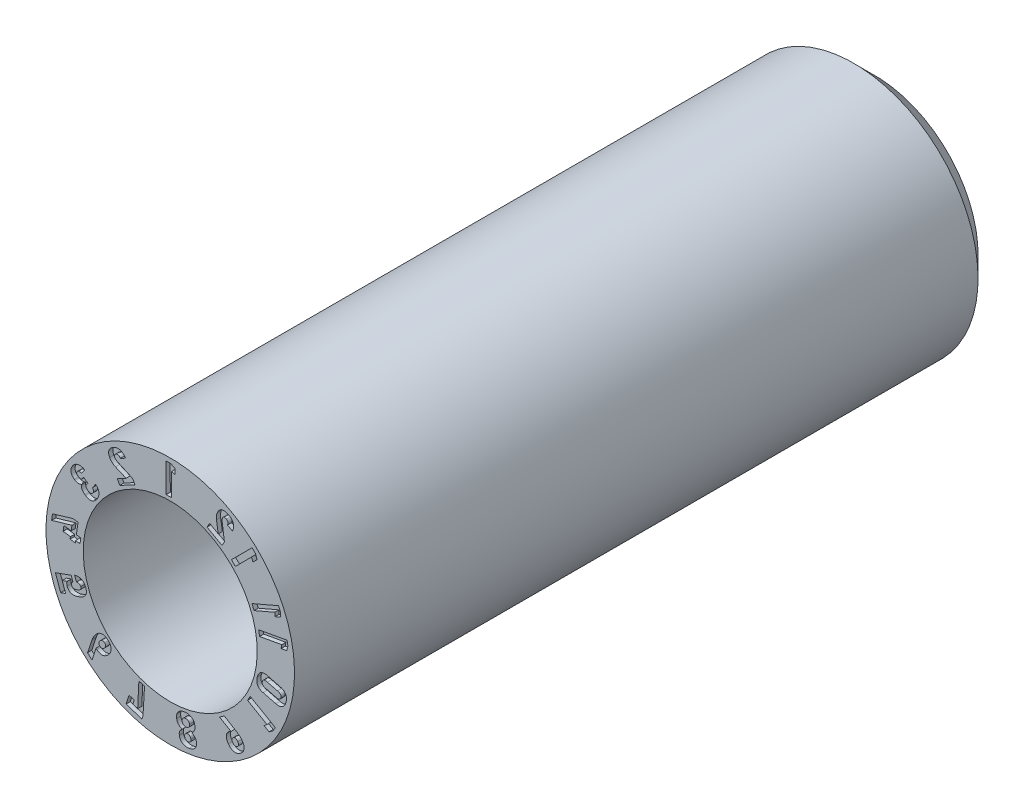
from build123d import *

# Parameters (mm, degrees)
CUT_EXTRUDE1_DEPTH = 0.1


with BuildPart() as part:
    # Sketch1 → Revolve1 (revolve)
    with BuildSketch(Plane(origin=(0, 0, 0), x_dir=(0, 0, -1), z_dir=(1, 0, 0)), mode=Mode.PRIVATE) as revolve1_sk:
        Polygon((17, 1.5), (17, 2.5), (16.5, 3), (0, 3), (0, 2.1), (3, 2.1), (3, 0.8), (12, 0.8), (12, 1.5), align=None)
    revolve(revolve1_sk.sketch.rotate(Axis((0, 0, 0), (0, 0, -1)), 180), axis=Axis((0, 0, 0), (0, 0, -1)))

    # Sketch2 → Cut-Extrude1 (cut)
    # profile 1 of 15: a face of its own
    with BuildSketch(Plane.XY):
        Polygon((-0.098720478, 2.183361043), (0.033456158, 2.18410041), (0.030635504, 2.730707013), (0.116357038, 2.698664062), (0.115654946, 2.839287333), (0.010584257, 2.885948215), (-0.102281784, 2.885328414), align=None)
    # profile 2 of 15: a face of its own
    with BuildSketch(Plane.XY):
        with BuildLine():
            Line((-0.909098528, 2.115845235), (-1.270014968, 2.279834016))
            add(Edge.make_bspline(
                [(-1.270014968, 2.279834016), (-1.285183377, 2.286827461), (-1.303513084, 2.297164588), (-1.321424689, 2.313703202), (-1.331285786, 2.324078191), (-1.337237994, 2.332679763), (-1.34046237, 2.338587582)],
                knots=[0, 0, 0, 0, 0.540031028, 0.66553244, 0.783527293, 1, 1, 1, 1], degree=3))
            add(Edge.make_bspline(
                [(-1.34046237, 2.338587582), (-1.345191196, 2.346859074), (-1.349282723, 2.358912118), (-1.349080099, 2.375373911), (-1.34593905, 2.38686971), (-1.340065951, 2.397752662), (-1.328125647, 2.411955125), (-1.315859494, 2.419934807), (-1.307070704, 2.424732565)],
                knots=[0, 0, 0, 0, 0.246786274, 0.356909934, 0.46944845, 0.586307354, 0.710253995, 1, 1, 1, 1], degree=3))
            add(Edge.make_bspline(
                [(-1.307070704, 2.424732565), (-1.298254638, 2.429437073), (-1.283992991, 2.434470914), (-1.264274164, 2.434539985), (-1.250034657, 2.431328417), (-1.236301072, 2.425121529), (-1.217968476, 2.412442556), (-1.206702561, 2.399086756), (-1.199905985, 2.389271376)],
                knots=[0, 0, 0, 0, 0.240300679, 0.353786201, 0.468512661, 0.587496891, 0.71289196, 1, 1, 1, 1], degree=3))
            Line((-1.199905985, 2.389271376), (-1.080740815, 2.452863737))
            add(Edge.make_bspline(
                [(-1.080740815, 2.452863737), (-1.091852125, 2.470709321), (-1.110121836, 2.494775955), (-1.13894901, 2.521479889), (-1.161443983, 2.537524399), (-1.185017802, 2.550216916), (-1.209502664, 2.559421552), (-1.234868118, 2.56462525), (-1.260823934, 2.566464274), (-1.287247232, 2.564674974), (-1.323430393, 2.556885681), (-1.349667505, 2.546235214), (-1.366473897, 2.53703459)],
                knots=[0, 0, 0, 0, 0.185247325, 0.270908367, 0.35379884, 0.433963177, 0.511943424, 0.589014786, 0.666847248, 0.746166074, 0.827198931, 1, 1, 1, 1], degree=3))
            add(Edge.make_bspline(
                [(-1.366473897, 2.53703459), (-1.384304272, 2.527354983), (-1.409307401, 2.511340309), (-1.437802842, 2.485684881), (-1.454939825, 2.465742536), (-1.468681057, 2.444841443), (-1.478807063, 2.422955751), (-1.485462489, 2.400219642), (-1.488089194, 2.376638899), (-1.487354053, 2.352479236), (-1.480773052, 2.318756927), (-1.470657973, 2.294302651), (-1.462098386, 2.278504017)],
                knots=[0, 0, 0, 0, 0.194582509, 0.283014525, 0.366623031, 0.445927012, 0.521986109, 0.596944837, 0.671952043, 0.748457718, 0.827747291, 1, 1, 1, 1], degree=3))
            add(Edge.make_bspline(
                [(-1.462098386, 2.278504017), (-1.454227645, 2.264109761), (-1.441177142, 2.243880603), (-1.420009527, 2.219623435), (-1.402682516, 2.202363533), (-1.383956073, 2.186555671), (-1.35741098, 2.168042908), (-1.336191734, 2.156382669), (-1.321424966, 2.150036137)],
                knots=[0, 0, 0, 0, 0.24663637, 0.371530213, 0.498650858, 0.625608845, 0.751024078, 1, 1, 1, 1], degree=3))
            Line((-1.321424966, 2.150036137), (-1.066700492, 2.040346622))
            Line((-1.066700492, 2.040346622), (-1.277167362, 1.926913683))
            Line((-1.277167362, 1.926913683), (-1.216935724, 1.815090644))
            Line((-1.216935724, 1.815090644), (-0.852820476, 2.011242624))
            Line((-0.852820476, 2.011242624), (-0.909098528, 2.115845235))
        make_face()
    # profile 3 of 15: a face of its own
    with BuildSketch(Plane.XY):
        with BuildLine():
            Line((-1.801883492, 1.544980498), (-1.880006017, 1.43385943))
            add(Edge.make_bspline(
                [(-1.880006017, 1.43385943), (-1.87487862, 1.429308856), (-1.868086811, 1.421837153), (-1.860996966, 1.410811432), (-1.856895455, 1.402559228), (-1.854247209, 1.3940888), (-1.85252689, 1.38557761), (-1.852072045, 1.37699943), (-1.852601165, 1.368357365), (-1.854488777, 1.359803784), (-1.8583708, 1.348138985), (-1.863371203, 1.340103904), (-1.866839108, 1.334788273)],
                knots=[0, 0, 0, 0, 0.185947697, 0.272003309, 0.355057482, 0.435080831, 0.512072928, 0.590042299, 0.667454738, 0.746220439, 0.82700958, 1, 1, 1, 1], degree=3))
            add(Edge.make_bspline(
                [(-1.866839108, 1.334788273), (-1.873178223, 1.325537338), (-1.884411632, 1.313429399), (-1.902828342, 1.302947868), (-1.917078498, 1.298987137), (-1.931923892, 1.298289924), (-1.953029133, 1.302259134), (-1.967701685, 1.310347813), (-1.97703908, 1.31673151)],
                knots=[0, 0, 0, 0, 0.265501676, 0.382853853, 0.496663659, 0.611874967, 0.731229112, 1, 1, 1, 1], degree=3))
            Line((-1.97703908, 1.31673151), (-1.990372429, 1.326052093))
            add(Edge.make_bspline(
                [(-1.990372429, 1.326052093), (-1.999848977, 1.333083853), (-2.013496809, 1.343714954), (-2.025737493, 1.361652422), (-2.031598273, 1.374526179), (-2.034274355, 1.387715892), (-2.032931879, 1.405850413), (-2.027186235, 1.418607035), (-2.021608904, 1.426083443)],
                knots=[0, 0, 0, 0, 0.300615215, 0.428560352, 0.545417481, 0.656048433, 0.764757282, 1, 1, 1, 1], degree=3))
            Line((-2.021608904, 1.426083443), (-1.987644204, 1.474290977))
            Line((-1.987644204, 1.474290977), (-2.091297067, 1.547206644))
            Line((-2.091297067, 1.547206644), (-2.125261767, 1.498999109))
            add(Edge.make_bspline(
                [(-2.125261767, 1.498999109), (-2.129461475, 1.49262222), (-2.137924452, 1.484861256), (-2.151872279, 1.479097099), (-2.163256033, 1.47786373), (-2.175428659, 1.478828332), (-2.193267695, 1.484488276), (-2.206151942, 1.491513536), (-2.214435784, 1.497553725)],
                knots=[0, 0, 0, 0, 0.226652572, 0.333129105, 0.444988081, 0.564971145, 0.694921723, 1, 1, 1, 1], degree=3))
            Line((-2.214435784, 1.497553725), (-2.224150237, 1.504381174))
            add(Edge.make_bspline(
                [(-2.224150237, 1.504381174), (-2.231925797, 1.509976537), (-2.242700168, 1.519001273), (-2.252270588, 1.534005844), (-2.256502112, 1.545122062), (-2.257906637, 1.556563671), (-2.256464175, 1.572471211), (-2.250509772, 1.583455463), (-2.245918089, 1.590224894)],
                knots=[0, 0, 0, 0, 0.287811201, 0.411477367, 0.527914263, 0.639876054, 0.752930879, 1, 1, 1, 1], degree=3))
            add(Edge.make_bspline(
                [(-2.245918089, 1.590224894), (-2.242607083, 1.594914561), (-2.236845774, 1.6014217), (-2.227352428, 1.607787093), (-2.219822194, 1.611738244), (-2.211638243, 1.614680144), (-2.202886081, 1.616398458), (-2.193590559, 1.617056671), (-2.18386769, 1.616803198), (-2.173733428, 1.615322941), (-2.15932377, 1.611916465), (-2.148708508, 1.607590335), (-2.14158886, 1.604363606)],
                knots=[0, 0, 0, 0, 0.150181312, 0.223296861, 0.297155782, 0.371585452, 0.449302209, 0.52905163, 0.614285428, 0.702508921, 0.795752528, 1, 1, 1, 1], degree=3))
            Line((-2.14158886, 1.604363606), (-2.063773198, 1.715071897))
            add(Edge.make_bspline(
                [(-2.063773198, 1.715071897), (-2.081248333, 1.725217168), (-2.108368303, 1.737622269), (-2.14599919, 1.747445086), (-2.173334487, 1.750835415), (-2.200112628, 1.750925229), (-2.226050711, 1.747485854), (-2.250939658, 1.740533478), (-2.274718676, 1.730366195), (-2.297037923, 1.716989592), (-2.325229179, 1.695251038), (-2.342768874, 1.674601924), (-2.353244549, 1.659856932)],
                knots=[0, 0, 0, 0, 0.185487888, 0.271925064, 0.356056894, 0.437650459, 0.51709444, 0.595429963, 0.674142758, 0.753752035, 0.833670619, 1, 1, 1, 1], degree=3))
            add(Edge.make_bspline(
                [(-2.353244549, 1.659856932), (-2.361796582, 1.64799191), (-2.372736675, 1.629611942), (-2.384516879, 1.60441102), (-2.391052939, 1.586165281), (-2.395609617, 1.568116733), (-2.398086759, 1.550254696), (-2.39865307, 1.532640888), (-2.397130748, 1.515325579), (-2.39392962, 1.498396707), (-2.388440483, 1.482094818), (-2.381277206, 1.466266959), (-2.37218256, 1.450999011), (-2.360976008, 1.436445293), (-2.342960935, 1.417467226), (-2.32760687, 1.404478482), (-2.316246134, 1.39674606)],
                knots=[0, 0, 0, 0, 0.145024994, 0.211773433, 0.275829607, 0.33708983, 0.396197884, 0.454480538, 0.511605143, 0.568407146, 0.625059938, 0.681891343, 0.740573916, 0.801023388, 0.86380105, 1, 1, 1, 1], degree=3))
            Line((-2.316246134, 1.39674606), (-2.299015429, 1.384577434))
            add(Edge.make_bspline(
                [(-2.299015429, 1.384577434), (-2.286442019, 1.376020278), (-2.266469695, 1.364783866), (-2.237435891, 1.357699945), (-2.215827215, 1.355422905), (-2.194139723, 1.35676088), (-2.165045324, 1.363515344), (-2.144565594, 1.373609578), (-2.131738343, 1.381993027)],
                knots=[0, 0, 0, 0, 0.256766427, 0.378902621, 0.5000938, 0.620743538, 0.742279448, 1, 1, 1, 1], degree=3))
            add(Edge.make_bspline(
                [(-2.131738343, 1.381993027), (-2.135009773, 1.374313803), (-2.138503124, 1.362462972), (-2.141321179, 1.346437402), (-2.142113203, 1.334574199), (-2.141599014, 1.3227474), (-2.140234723, 1.310947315), (-2.13730727, 1.299279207), (-2.132195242, 1.283644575), (-2.122651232, 1.264537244), (-2.100992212, 1.234755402), (-2.079355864, 1.215986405), (-2.063356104, 1.204800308)],
                knots=[0, 0, 0, 0, 0.120941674, 0.178737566, 0.235932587, 0.293131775, 0.35041005, 0.40804081, 0.467422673, 0.589011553, 0.716165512, 1, 1, 1, 1], degree=3))
            Line((-2.063356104, 1.204800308), (-2.045991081, 1.192679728))
            add(Edge.make_bspline(
                [(-2.045991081, 1.192679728), (-2.030330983, 1.182031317), (-2.006328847, 1.167678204), (-1.971978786, 1.156440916), (-1.947194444, 1.151756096), (-1.922643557, 1.151045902), (-1.898606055, 1.154169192), (-1.875036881, 1.160844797), (-1.852264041, 1.1716141), (-1.830145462, 1.185815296), (-1.801006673, 1.210402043), (-1.782348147, 1.233301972), (-1.770636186, 1.249662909)],
                knots=[0, 0, 0, 0, 0.178299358, 0.259714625, 0.338098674, 0.414262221, 0.489195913, 0.564778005, 0.643203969, 0.72472314, 0.810857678, 1, 1, 1, 1], degree=3))
            add(Edge.make_bspline(
                [(-1.770636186, 1.249662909), (-1.759102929, 1.266092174), (-1.74414016, 1.291714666), (-1.730625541, 1.327993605), (-1.723986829, 1.354740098), (-1.721156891, 1.381433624), (-1.721493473, 1.407775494), (-1.725987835, 1.433510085), (-1.733635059, 1.458646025), (-1.74515969, 1.482723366), (-1.766077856, 1.513511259), (-1.786625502, 1.533300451), (-1.801883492, 1.544980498)],
                knots=[0, 0, 0, 0, 0.181472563, 0.266227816, 0.349030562, 0.429720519, 0.508099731, 0.586210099, 0.664894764, 0.744781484, 0.826358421, 1, 1, 1, 1], degree=3))
        make_face()
    # profile 4 of 15: a face of its own
    with BuildSketch(Plane.XY):
        Polygon((-2.346366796, 0.556911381), (-2.843020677, 0.40892151), (-2.863791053, 0.261124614), (-2.373786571, 0.404048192), (-2.391588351, 0.277639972), (-2.56712748, 0.302390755), (-2.585641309, 0.171756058), (-2.409987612, 0.14698912), (-2.417640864, 0.092644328), (-2.291825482, 0.074920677), (-2.284166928, 0.129248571), (-2.177397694, 0.114194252), (-2.158883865, 0.244828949), (-2.265749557, 0.259896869), (-2.226272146, 0.539939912), align=None)
    # profile 5 of 15: a face of its own
    with BuildSketch(Plane.XY):
        with BuildLine():
            Line((-2.307233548, -0.60438587), (-2.263150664, -0.729175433))
            add(Edge.make_bspline(
                [(-2.263150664, -0.729175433), (-2.251377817, -0.726141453), (-2.234344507, -0.723644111), (-2.212524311, -0.726198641), (-2.198187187, -0.730522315), (-2.185600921, -0.737514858), (-2.170980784, -0.750226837), (-2.163998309, -0.763355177), (-2.160560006, -0.772475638)],
                knots=[0, 0, 0, 0, 0.285979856, 0.41291731, 0.532388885, 0.648288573, 0.760985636, 1, 1, 1, 1], degree=3))
            add(Edge.make_bspline(
                [(-2.160560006, -0.772475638), (-2.157176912, -0.782326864), (-2.153751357, -0.797843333), (-2.157623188, -0.817807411), (-2.163482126, -0.831313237), (-2.172841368, -0.8434212), (-2.189938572, -0.858644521), (-2.206436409, -0.866138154), (-2.217988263, -0.870396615)],
                knots=[0, 0, 0, 0, 0.245537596, 0.357255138, 0.469313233, 0.585744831, 0.711147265, 1, 1, 1, 1], degree=3))
            Line((-2.217988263, -0.870396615), (-2.273510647, -0.890140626))
            add(Edge.make_bspline(
                [(-2.273510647, -0.890140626), (-2.285083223, -0.894275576), (-2.302260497, -0.898817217), (-2.324790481, -0.898989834), (-2.339182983, -0.896006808), (-2.351935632, -0.890541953), (-2.36642434, -0.879038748), (-2.37356739, -0.866792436), (-2.376612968, -0.857940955)],
                knots=[0, 0, 0, 0, 0.302844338, 0.431574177, 0.550434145, 0.661796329, 0.76957872, 1, 1, 1, 1], degree=3))
            add(Edge.make_bspline(
                [(-2.376612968, -0.857940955), (-2.379604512, -0.849558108), (-2.382537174, -0.836648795), (-2.382109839, -0.819389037), (-2.379664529, -0.807255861), (-2.375219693, -0.795769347), (-2.366577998, -0.781415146), (-2.357286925, -0.772584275), (-2.350456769, -0.767510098)],
                knots=[0, 0, 0, 0, 0.263342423, 0.385862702, 0.507647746, 0.627191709, 0.748065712, 1, 1, 1, 1], degree=3))
            Line((-2.350456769, -0.767510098), (-2.392047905, -0.651183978))
            Line((-2.392047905, -0.651183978), (-2.772130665, -0.786810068))
            Line((-2.772130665, -0.786810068), (-2.645335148, -1.141872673))
            Line((-2.645335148, -1.141872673), (-2.525233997, -1.099040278))
            Line((-2.525233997, -1.099040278), (-2.607524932, -0.868607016))
            Line((-2.607524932, -0.868607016), (-2.490777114, -0.82685566))
            add(Edge.make_bspline(
                [(-2.490777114, -0.82685566), (-2.49394469, -0.833524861), (-2.496743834, -0.844617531), (-2.498627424, -0.860252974), (-2.498859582, -0.886118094), (-2.494910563, -0.907827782), (-2.489257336, -0.924336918)],
                knots=[0, 0, 0, 0, 0.221259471, 0.34293735, 0.47419753, 1, 1, 1, 1], degree=3))
            add(Edge.make_bspline(
                [(-2.489257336, -0.924336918), (-2.483531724, -0.940369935), (-2.472446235, -0.962972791), (-2.452020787, -0.988595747), (-2.434556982, -1.004133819), (-2.415160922, -1.016893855), (-2.393590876, -1.026325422), (-2.37008561, -1.032336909), (-2.344788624, -1.035395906), (-2.317831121, -1.034945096), (-2.278429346, -1.03055616), (-2.248901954, -1.021685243), (-2.229006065, -1.014769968)],
                knots=[0, 0, 0, 0, 0.16365674, 0.239510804, 0.313508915, 0.387354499, 0.46174098, 0.538606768, 0.619722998, 0.705857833, 0.797118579, 1, 1, 1, 1], degree=3))
            Line((-2.229006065, -1.014769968), (-2.173483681, -0.995025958))
            add(Edge.make_bspline(
                [(-2.173483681, -0.995025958), (-2.15357459, -0.987921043), (-2.125327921, -0.975129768), (-2.092397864, -0.95226371), (-2.071928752, -0.933559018), (-2.054870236, -0.913083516), (-2.041499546, -0.890801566), (-2.031828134, -0.866841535), (-2.025784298, -0.841336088), (-2.023691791, -0.814434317), (-2.025934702, -0.775754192), (-2.033564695, -0.746761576), (-2.040346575, -0.727525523)],
                knots=[0, 0, 0, 0, 0.186939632, 0.272046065, 0.353268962, 0.431220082, 0.506711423, 0.581925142, 0.658650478, 0.737395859, 0.819503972, 1, 1, 1, 1], degree=3))
            add(Edge.make_bspline(
                [(-2.040346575, -0.727525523), (-2.046188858, -0.710429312), (-2.058159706, -0.686374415), (-2.079354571, -0.658084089), (-2.097480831, -0.639744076), (-2.117791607, -0.624016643), (-2.140312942, -0.611682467), (-2.16453337, -0.601967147), (-2.190652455, -0.595682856), (-2.21827195, -0.592599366), (-2.257699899, -0.59324521), (-2.287470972, -0.598758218), (-2.307233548, -0.60438587)],
                knots=[0, 0, 0, 0, 0.165351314, 0.244287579, 0.323078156, 0.400981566, 0.478830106, 0.557643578, 0.63948441, 0.724229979, 0.811685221, 1, 1, 1, 1], degree=3))
        make_face()
    # profile 6 of 15: a face of its own
    with BuildSketch(Plane.XY):
        with BuildLine():
            Line((-1.889555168, -1.75439237), (-1.995138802, -2.070022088))
            Line((-1.995138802, -2.070022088), (-1.887249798, -2.173115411))
            Line((-1.887249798, -2.173115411), (-1.789330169, -1.87100414))
            add(Edge.make_bspline(
                [(-1.789330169, -1.87100414), (-1.784440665, -1.877950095), (-1.778712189, -1.884315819), (-1.772623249, -1.890207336)],
                knots=[0.75991926, 0.75991926, 0.75991926, 0.75991926, 1, 1, 1, 1], degree=3))
            add(Edge.make_bspline(
                [(-1.772623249, -1.890207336), (-1.759601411, -1.902634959), (-1.738724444, -1.919069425), (-1.707734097, -1.933968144), (-1.684626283, -1.941262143), (-1.661036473, -1.944568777), (-1.637190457, -1.944477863), (-1.613290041, -1.940185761), (-1.589307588, -1.932493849), (-1.565541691, -1.920949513), (-1.532847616, -1.900391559), (-1.510793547, -1.880080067), (-1.496572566, -1.865343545)],
                knots=[0, 0, 0, 0, 0.171910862, 0.250610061, 0.326760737, 0.401984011, 0.476838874, 0.553147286, 0.632553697, 0.716253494, 0.804371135, 1, 1, 1, 1], degree=3))
            add(Edge.make_bspline(
                [(-1.496572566, -1.865343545), (-1.481622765, -1.85014492), (-1.462532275, -1.826047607), (-1.443272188, -1.791218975), (-1.433401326, -1.765533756), (-1.427161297, -1.739773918), (-1.425382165, -1.714036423), (-1.427328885, -1.688497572), (-1.433460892, -1.663326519), (-1.443364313, -1.638550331), (-1.4626649, -1.605456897), (-1.482096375, -1.583135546), (-1.496638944, -1.569183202)],
                knots=[0, 0, 0, 0, 0.187278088, 0.272506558, 0.353965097, 0.431955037, 0.507955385, 0.583051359, 0.659476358, 0.73805999, 0.820178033, 1, 1, 1, 1], degree=3))
            add(Edge.make_bspline(
                [(-1.496638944, -1.569183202), (-1.511075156, -1.555256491), (-1.534215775, -1.536912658), (-1.568088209, -1.519190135), (-1.593219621, -1.510142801), (-1.618595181, -1.505262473), (-1.644013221, -1.504199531), (-1.669414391, -1.507091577), (-1.694714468, -1.514027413), (-1.719586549, -1.52507634), (-1.753399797, -1.545202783), (-1.775894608, -1.565796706), (-1.790432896, -1.580566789)],
                knots=[0, 0, 0, 0, 0.180176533, 0.262990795, 0.342264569, 0.419092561, 0.494073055, 0.569806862, 0.647689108, 0.728633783, 0.813435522, 1, 1, 1, 1], degree=3))
            add(Edge.make_bspline(
                [(-1.790432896, -1.580566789), (-1.799795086, -1.590255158), (-1.81256956, -1.605552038), (-1.828327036, -1.627489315), (-1.851803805, -1.664362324), (-1.867935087, -1.697687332), (-1.878868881, -1.72535116)],
                knots=[0, 0, 0, 0, 0.23012337, 0.350638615, 0.475698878, 1, 1, 1, 1], degree=3))
            add(Edge.make_bspline(
                [(-1.878868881, -1.72535116), (-1.880807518, -1.730188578), (-1.884872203, -1.73968918), (-1.887855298, -1.74958136), (-1.889555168, -1.75439237)],
                knots=[0, 0, 0, 0, 0.505360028, 1, 1, 1, 1], degree=3))
        make_face()
        with BuildLine():
            add(Edge.make_bspline(
                [(-1.58446489, -1.660961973), (-1.576878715, -1.668197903), (-1.566966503, -1.68030344), (-1.560358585, -1.699200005), (-1.559032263, -1.71322572), (-1.5608835, -1.727359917), (-1.568083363, -1.746977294), (-1.57800407, -1.759998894), (-1.585782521, -1.767977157)],
                knots=[0, 0, 0, 0, 0.259879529, 0.375972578, 0.488654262, 0.604088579, 0.724463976, 1, 1, 1, 1], degree=3))
            add(Edge.make_bspline(
                [(-1.585782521, -1.767977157), (-1.595125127, -1.777630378), (-1.609077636, -1.790168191), (-1.630525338, -1.800199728), (-1.645643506, -1.804116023), (-1.660631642, -1.804200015), (-1.680571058, -1.799470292), (-1.693597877, -1.790304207), (-1.701198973, -1.783031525)],
                knots=[0, 0, 0, 0, 0.29446835, 0.419975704, 0.537202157, 0.647939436, 0.758506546, 1, 1, 1, 1], degree=3))
            add(Edge.make_bspline(
                [(-1.701198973, -1.783031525), (-1.708832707, -1.775869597), (-1.718397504, -1.763222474), (-1.723721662, -1.74342167), (-1.724048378, -1.728380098), (-1.720882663, -1.712957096), (-1.711445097, -1.691271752), (-1.700070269, -1.676542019), (-1.691133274, -1.667339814)],
                knots=[0, 0, 0, 0, 0.240160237, 0.350244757, 0.463156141, 0.580574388, 0.706813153, 1, 1, 1, 1], degree=3))
            add(Edge.make_bspline(
                [(-1.691133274, -1.667339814), (-1.683151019, -1.65896935), (-1.670579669, -1.648595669), (-1.651426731, -1.640334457), (-1.637402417, -1.637996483), (-1.623400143, -1.638720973), (-1.604500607, -1.644815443), (-1.591924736, -1.653657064), (-1.58446489, -1.660961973)],
                knots=[0, 0, 0, 0, 0.277061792, 0.397428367, 0.512562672, 0.626259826, 0.74139413, 1, 1, 1, 1], degree=3))
        make_face(mode=Mode.SUBTRACT)
    # profile 7 of 15: a face of its own
    with BuildSketch(Plane.XY):
        Polygon((-0.656910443, -2.717648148), (-0.621111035, -2.085762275), (-0.75755319, -2.042458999), (-0.785917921, -2.635211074), (-0.900624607, -2.598733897), (-0.86869984, -2.498108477), (-0.99463076, -2.458228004), (-1.065078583, -2.68015205), (-0.683448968, -2.801286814), align=None)
    # profile 8 of 15: a face of its own
    with BuildSketch(Plane.XY):
        with BuildLine():
            Line((0.15402425, -2.365748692), (0.155823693, -2.37716977))
            add(Edge.make_bspline(
                [(0.155823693, -2.37716977), (0.158453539, -2.394221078), (0.166390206, -2.419117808), (0.183362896, -2.449647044), (0.199706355, -2.470633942), (0.218346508, -2.489709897), (0.24660379, -2.510888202), (0.270589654, -2.522167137), (0.287386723, -2.527201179)],
                knots=[0, 0, 0, 0, 0.245950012, 0.369874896, 0.49730233, 0.62492344, 0.749887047, 1, 1, 1, 1], degree=3))
            add(Edge.make_bspline(
                [(0.287386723, -2.527201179), (0.275169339, -2.535813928), (0.258421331, -2.550942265), (0.24088397, -2.57516334), (0.230320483, -2.59475192), (0.222467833, -2.615250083), (0.216226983, -2.643095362), (0.216427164, -2.664453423), (0.218695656, -2.678293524)],
                knots=[0, 0, 0, 0, 0.25672613, 0.38363542, 0.511859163, 0.637851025, 0.759401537, 1, 1, 1, 1], degree=3))
            Line((0.218695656, -2.678293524), (0.221503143, -2.696440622))
            add(Edge.make_bspline(
                [(0.221503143, -2.696440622), (0.224278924, -2.713608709), (0.231279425, -2.738573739), (0.247242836, -2.768530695), (0.261878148, -2.788315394), (0.279135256, -2.805586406), (0.298863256, -2.820003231), (0.32062779, -2.8320291), (0.344740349, -2.840837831), (0.370584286, -2.846983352), (0.408079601, -2.850520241), (0.436893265, -2.848962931), (0.456239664, -2.845616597)],
                knots=[0, 0, 0, 0, 0.166884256, 0.246053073, 0.324355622, 0.40205567, 0.479238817, 0.557958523, 0.639715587, 0.724648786, 0.812018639, 1, 1, 1, 1], degree=3))
            add(Edge.make_bspline(
                [(0.456239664, -2.845616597), (0.475525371, -2.842319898), (0.503706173, -2.835589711), (0.537940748, -2.819980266), (0.560646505, -2.806272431), (0.580639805, -2.790269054), (0.59786071, -2.772215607), (0.611943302, -2.752178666), (0.623007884, -2.730384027), (0.630630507, -2.70707225), (0.636695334, -2.673707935), (0.635251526, -2.647799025), (0.632621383, -2.630622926)],
                knots=[0, 0, 0, 0, 0.188034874, 0.275676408, 0.359981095, 0.44181779, 0.520591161, 0.598494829, 0.675898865, 0.754168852, 0.832942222, 1, 1, 1, 1], degree=3))
            Line((0.632621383, -2.630622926), (0.629813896, -2.612475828))
            add(Edge.make_bspline(
                [(0.629813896, -2.612475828), (0.627769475, -2.598359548), (0.620924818, -2.57788996), (0.606156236, -2.553103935), (0.591974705, -2.536206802), (0.575611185, -2.521081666), (0.551316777, -2.503552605), (0.530315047, -2.494976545), (0.515945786, -2.490716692)],
                knots=[0, 0, 0, 0, 0.24262632, 0.364099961, 0.490538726, 0.617681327, 0.743637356, 1, 1, 1, 1], degree=3))
            add(Edge.make_bspline(
                [(0.515945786, -2.490716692), (0.530641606, -2.480685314), (0.549823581, -2.462084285), (0.570484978, -2.433114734), (0.582496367, -2.409215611), (0.591552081, -2.384178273), (0.598755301, -2.349993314), (0.598259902, -2.323789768), (0.595472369, -2.3067857)],
                knots=[0, 0, 0, 0, 0.252226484, 0.37699801, 0.504744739, 0.631563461, 0.754934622, 1, 1, 1, 1], degree=3))
            Line((0.595472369, -2.3067857), (0.593672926, -2.295364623))
            add(Edge.make_bspline(
                [(0.593672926, -2.295364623), (0.590963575, -2.277042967), (0.583289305, -2.250618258), (0.566399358, -2.218825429), (0.550750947, -2.19797344), (0.532340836, -2.17976148), (0.511566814, -2.16404827), (0.487937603, -2.15194478), (0.462308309, -2.14242158), (0.434622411, -2.136277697), (0.39457444, -2.132061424), (0.363678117, -2.134461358), (0.342958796, -2.13777292)],
                knots=[0, 0, 0, 0, 0.166554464, 0.245225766, 0.322916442, 0.40024906, 0.47767046, 0.556368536, 0.638319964, 0.723174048, 0.810916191, 1, 1, 1, 1], degree=3))
            add(Edge.make_bspline(
                [(0.342958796, -2.13777292), (0.322326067, -2.141328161), (0.29210764, -2.148312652), (0.25547311, -2.165005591), (0.231139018, -2.179474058), (0.209747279, -2.196473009), (0.191222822, -2.21541458), (0.176173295, -2.236711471), (0.164358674, -2.259825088), (0.156016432, -2.284546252), (0.149964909, -2.320023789), (0.150942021, -2.347472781), (0.15402425, -2.365748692)],
                knots=[0, 0, 0, 0, 0.188976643, 0.276820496, 0.361568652, 0.443246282, 0.522147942, 0.59929835, 0.677100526, 0.755105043, 0.833250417, 1, 1, 1, 1], degree=3))
        make_face()
        with BuildLine():
            Line((0.466058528, -2.335179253), (0.467066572, -2.341905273))
            add(Edge.make_bspline(
                [(0.467066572, -2.341905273), (0.468120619, -2.349299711), (0.468826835, -2.360486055), (0.466156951, -2.37490175), (0.462672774, -2.384919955), (0.457802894, -2.394244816), (0.451792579, -2.402921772), (0.444251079, -2.410644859), (0.435572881, -2.417546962), (0.425746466, -2.423440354), (0.410957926, -2.43019933), (0.398770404, -2.433062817), (0.390421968, -2.434498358)],
                knots=[0, 0, 0, 0, 0.166389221, 0.245774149, 0.32412705, 0.401036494, 0.47875356, 0.557638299, 0.639825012, 0.724352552, 0.811459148, 1, 1, 1, 1], degree=3))
            add(Edge.make_bspline(
                [(0.390421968, -2.434498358), (0.382020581, -2.435720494), (0.369543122, -2.436849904), (0.35332663, -2.435072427), (0.342191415, -2.432482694), (0.331756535, -2.428684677), (0.322386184, -2.423385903), (0.313753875, -2.417173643), (0.306181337, -2.409689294), (0.299739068, -2.4011346), (0.292886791, -2.388157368), (0.289699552, -2.377461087), (0.288617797, -2.370038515)],
                knots=[0, 0, 0, 0, 0.1884736, 0.275197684, 0.360268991, 0.441190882, 0.520184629, 0.597925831, 0.676115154, 0.755045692, 0.834172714, 1, 1, 1, 1], degree=3))
            Line((0.288617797, -2.370038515), (0.287476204, -2.362905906))
            add(Edge.make_bspline(
                [(0.287476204, -2.362905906), (0.286210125, -2.35487403), (0.285686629, -2.342882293), (0.287968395, -2.327291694), (0.291367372, -2.316505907), (0.29597198, -2.306278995), (0.302137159, -2.297095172), (0.309575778, -2.288795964), (0.31826962, -2.281524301), (0.328026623, -2.27507128), (0.342874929, -2.268336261), (0.354808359, -2.264858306), (0.363157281, -2.26372233)],
                knots=[0, 0, 0, 0, 0.173777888, 0.254717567, 0.335682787, 0.414820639, 0.493742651, 0.571176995, 0.652365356, 0.735479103, 0.820480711, 1, 1, 1, 1], degree=3))
            add(Edge.make_bspline(
                [(0.363157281, -2.26372233), (0.371494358, -2.262303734), (0.383969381, -2.261704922), (0.400168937, -2.263725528), (0.411402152, -2.266821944), (0.421876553, -2.271254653), (0.43165422, -2.276686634), (0.440170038, -2.28392407), (0.44783027, -2.292123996), (0.454367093, -2.301504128), (0.4616588, -2.315503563), (0.464805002, -2.327179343), (0.466058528, -2.335179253)],
                knots=[0, 0, 0, 0, 0.18005291, 0.26436873, 0.347011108, 0.427480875, 0.506430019, 0.584318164, 0.664589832, 0.745065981, 0.827209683, 1, 1, 1, 1], degree=3))
        make_face(mode=Mode.SUBTRACT)
        with BuildLine():
            Line((0.498290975, -2.62804849), (0.499299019, -2.634774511))
            add(Edge.make_bspline(
                [(0.499299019, -2.634774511), (0.500263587, -2.641646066), (0.501132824, -2.651958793), (0.498997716, -2.665277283), (0.496369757, -2.6745306), (0.492626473, -2.683269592), (0.487413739, -2.691083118), (0.481331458, -2.698318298), (0.474025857, -2.70454837), (0.465843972, -2.709997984), (0.453358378, -2.715903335), (0.443078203, -2.7184492), (0.43604118, -2.719667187)],
                knots=[0, 0, 0, 0, 0.175248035, 0.257090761, 0.338037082, 0.416806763, 0.495075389, 0.573435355, 0.653849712, 0.735674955, 0.820090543, 1, 1, 1, 1], degree=3))
            add(Edge.make_bspline(
                [(0.43604118, -2.719667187), (0.428998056, -2.720669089), (0.41840988, -2.721682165), (0.404776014, -2.719584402), (0.395237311, -2.717313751), (0.386423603, -2.713462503), (0.37834067, -2.708613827), (0.371019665, -2.702640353), (0.364659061, -2.695495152), (0.359093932, -2.687447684), (0.353345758, -2.675087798), (0.350485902, -2.665116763), (0.349471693, -2.658161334)],
                knots=[0, 0, 0, 0, 0.179111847, 0.262746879, 0.344693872, 0.424028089, 0.502580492, 0.58023367, 0.659692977, 0.741501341, 0.824386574, 1, 1, 1, 1], degree=3))
            Line((0.349471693, -2.658161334), (0.3483301, -2.651028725))
            add(Edge.make_bspline(
                [(0.3483301, -2.651028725), (0.347010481, -2.643822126), (0.346574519, -2.633008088), (0.348124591, -2.61891207), (0.350907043, -2.609129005), (0.354575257, -2.599911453), (0.359484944, -2.591432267), (0.365766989, -2.584008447), (0.372851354, -2.57721879), (0.381088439, -2.571567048), (0.393447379, -2.565246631), (0.403672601, -2.562354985), (0.410752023, -2.561305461)],
                knots=[0, 0, 0, 0, 0.17820891, 0.262813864, 0.344874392, 0.425545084, 0.504461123, 0.582683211, 0.662100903, 0.743229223, 0.825445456, 1, 1, 1, 1], degree=3))
            add(Edge.make_bspline(
                [(0.410752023, -2.561305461), (0.41783279, -2.56003639), (0.428455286, -2.559646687), (0.442196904, -2.56168821), (0.451738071, -2.5645862), (0.460598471, -2.568736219), (0.46877519, -2.574011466), (0.47619028, -2.58043894), (0.482584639, -2.588207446), (0.488158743, -2.596857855), (0.494221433, -2.609984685), (0.497287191, -2.620603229), (0.498290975, -2.62804849)],
                knots=[0, 0, 0, 0, 0.17383815, 0.255176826, 0.335334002, 0.414325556, 0.491269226, 0.570235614, 0.650821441, 0.734020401, 0.818687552, 1, 1, 1, 1], degree=3))
        make_face(mode=Mode.SUBTRACT)
    # profile 9 of 15: a face of its own
    with BuildSketch(Plane.XY):
        with BuildLine():
            Line((1.580014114, -1.910742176), (1.303672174, -1.74211754))
            Line((1.303672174, -1.74211754), (1.191272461, -1.823730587))
            Line((1.191272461, -1.823730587), (1.466692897, -1.985341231))
            add(Edge.make_bspline(
                [(1.466692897, -1.985341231), (1.466036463, -1.985560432), (1.460942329, -1.987306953), (1.446345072, -1.993282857), (1.433660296, -2.001593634), (1.425177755, -2.007488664)],
                knots=[0.563271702, 0.563271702, 0.563271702, 0.563271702, 0.582456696, 0.712545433, 1, 1, 1, 1], degree=3))
            add(Edge.make_bspline(
                [(1.425177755, -2.007488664), (1.411813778, -2.017393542), (1.39329394, -2.034066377), (1.374928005, -2.061004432), (1.364444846, -2.082306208), (1.357498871, -2.104907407), (1.353544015, -2.128363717), (1.353350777, -2.152647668), (1.356359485, -2.177506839), (1.362913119, -2.202608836), (1.375985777, -2.237024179), (1.390863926, -2.261148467), (1.401990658, -2.27674116)],
                knots=[0, 0, 0, 0, 0.164686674, 0.242999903, 0.32077056, 0.398262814, 0.475705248, 0.554875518, 0.637235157, 0.72230948, 0.81046721, 1, 1, 1, 1], degree=3))
            add(Edge.make_bspline(
                [(1.401990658, -2.27674116), (1.414817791, -2.293949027), (1.434594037, -2.317587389), (1.465631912, -2.342429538), (1.488882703, -2.356977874), (1.513084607, -2.367449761), (1.53784871, -2.374063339), (1.563231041, -2.376691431), (1.589043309, -2.37523091), (1.61513957, -2.369752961), (1.651109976, -2.356761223), (1.676594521, -2.341812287), (1.692832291, -2.329914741)],
                knots=[0, 0, 0, 0, 0.187674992, 0.273075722, 0.35439933, 0.43207934, 0.507842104, 0.582607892, 0.659159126, 0.73796091, 0.820071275, 1, 1, 1, 1], degree=3))
            add(Edge.make_bspline(
                [(1.692832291, -2.329914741), (1.709090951, -2.318252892), (1.731162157, -2.298791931), (1.75447012, -2.268620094), (1.767566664, -2.245335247), (1.776688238, -2.220991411), (1.782076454, -2.195851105), (1.783249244, -2.169964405), (1.780656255, -2.143472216), (1.774210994, -2.116485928), (1.759440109, -2.079223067), (1.743754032, -2.052542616), (1.731094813, -2.035566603)],
                knots=[0, 0, 0, 0, 0.17804964, 0.259654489, 0.338129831, 0.414765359, 0.490064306, 0.565893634, 0.644318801, 0.726149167, 0.811832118, 1, 1, 1, 1], degree=3))
            add(Edge.make_bspline(
                [(1.731094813, -2.035566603), (1.723805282, -2.025325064), (1.711618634, -2.011164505), (1.693491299, -1.993298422), (1.678165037, -1.979800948), (1.661550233, -1.966277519), (1.636950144, -1.947911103), (1.61757332, -1.934500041), (1.604071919, -1.92577962)],
                knots=[0, 0, 0, 0, 0.216626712, 0.332172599, 0.453193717, 0.580305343, 0.713713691, 1, 1, 1, 1], degree=3))
            add(Edge.make_bspline(
                [(1.604071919, -1.92577962), (1.600102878, -1.923121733), (1.592090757, -1.918095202), (1.584268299, -1.912753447), (1.580014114, -1.910742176)],
                knots=[0, 0, 0, 0, 0.504712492, 1, 1, 1, 1], degree=3))
        make_face()
        with BuildLine():
            add(Edge.make_bspline(
                [(1.519403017, -2.090839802), (1.527778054, -2.08469599), (1.541643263, -2.077416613), (1.56171989, -2.075222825), (1.576196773, -2.077128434), (1.590441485, -2.082189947), (1.609318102, -2.094466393), (1.621187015, -2.107511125), (1.628215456, -2.117430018)],
                knots=[0, 0, 0, 0, 0.246692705, 0.358778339, 0.471983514, 0.588823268, 0.712749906, 1, 1, 1, 1], degree=3))
            add(Edge.make_bspline(
                [(1.628215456, -2.117430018), (1.635271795, -2.127352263), (1.644120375, -2.142076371), (1.649039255, -2.163333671), (1.649356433, -2.178043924), (1.646414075, -2.192065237), (1.637385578, -2.20986232), (1.626518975, -2.220793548), (1.617959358, -2.226761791)],
                knots=[0, 0, 0, 0, 0.283249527, 0.406264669, 0.522768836, 0.635824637, 0.748302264, 1, 1, 1, 1], degree=3))
            add(Edge.make_bspline(
                [(1.617959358, -2.226761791), (1.609479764, -2.232843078), (1.595675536, -2.240298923), (1.57574012, -2.242932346), (1.561411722, -2.241527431), (1.547468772, -2.236585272), (1.528898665, -2.225010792), (1.517401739, -2.212255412), (1.510562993, -2.20273323)],
                knots=[0, 0, 0, 0, 0.25214523, 0.365991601, 0.478154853, 0.594597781, 0.717792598, 1, 1, 1, 1], degree=3))
            add(Edge.make_bspline(
                [(1.510562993, -2.20273323), (1.503107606, -2.192501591), (1.494287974, -2.177219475), (1.488656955, -2.155494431), (1.488164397, -2.140530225), (1.490857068, -2.126192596), (1.499744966, -2.107980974), (1.510851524, -2.096931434), (1.519403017, -2.090839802)],
                knots=[0, 0, 0, 0, 0.287540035, 0.410630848, 0.526441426, 0.63843737, 0.751687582, 1, 1, 1, 1], degree=3))
        make_face(mode=Mode.SUBTRACT)
    # profile 10 of 15: a face of its own
    with BuildSketch(Plane.XY):
        Polygon((1.931933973, -1.021612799), (1.866147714, -1.135234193), (2.335575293, -1.40724765), (2.265012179, -1.464588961), (2.385768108, -1.534508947), (2.478564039, -1.468052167), (2.534811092, -1.371072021), align=None)
    # profile 11 of 15: a face of its own
    with BuildSketch(Plane.XY):
        with BuildLine():
            Line((2.240299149, -0.786701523), (2.549818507, -0.865178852))
            add(Edge.make_bspline(
                [(2.549818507, -0.865178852), (2.564340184, -0.868673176), (2.585918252, -0.872934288), (2.614465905, -0.87417158), (2.634453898, -0.873178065), (2.653631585, -0.870189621), (2.671923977, -0.865226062), (2.689373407, -0.858246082), (2.705888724, -0.849378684), (2.721377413, -0.838575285), (2.735675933, -0.825860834), (2.748590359, -0.811172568), (2.760533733, -0.794779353), (2.770884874, -0.776305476), (2.783681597, -0.748556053), (2.791047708, -0.726157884), (2.794823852, -0.710490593)],
                knots=[0, 0, 0, 0, 0.13593978, 0.198951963, 0.259288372, 0.317550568, 0.375017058, 0.431183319, 0.488002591, 0.545020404, 0.602438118, 0.661459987, 0.722464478, 0.786441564, 0.853570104, 1, 1, 1, 1], degree=3))
            add(Edge.make_bspline(
                [(2.794823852, -0.710490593), (2.798723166, -0.694803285), (2.80323997, -0.671599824), (2.805308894, -0.641007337), (2.804925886, -0.619777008), (2.802334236, -0.599655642), (2.797920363, -0.58062273), (2.791623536, -0.562629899), (2.783141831, -0.545822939), (2.772792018, -0.530286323), (2.760844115, -0.51587871), (2.747030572, -0.50286521), (2.731504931, -0.491249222), (2.714409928, -0.480787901), (2.68857822, -0.468410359), (2.66757839, -0.461645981), (2.653035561, -0.45788484)],
                knots=[0, 0, 0, 0, 0.146899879, 0.213952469, 0.278179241, 0.339428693, 0.397852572, 0.455344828, 0.512130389, 0.568349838, 0.624567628, 0.681763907, 0.740275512, 0.800381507, 0.863506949, 1, 1, 1, 1], degree=3))
            Line((2.653035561, -0.45788484), (2.343516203, -0.379407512))
            add(Edge.make_bspline(
                [(2.343516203, -0.379407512), (2.328994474, -0.37591305), (2.307416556, -0.371652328), (2.278868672, -0.370414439), (2.258881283, -0.371409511), (2.239768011, -0.374382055), (2.221481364, -0.379354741), (2.204072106, -0.386265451), (2.187591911, -0.395200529), (2.172148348, -0.405950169), (2.157855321, -0.418670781), (2.14492754, -0.43335037), (2.13303386, -0.449774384), (2.122481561, -0.468131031), (2.109694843, -0.495899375), (2.102644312, -0.518396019), (2.098578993, -0.533970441)],
                knots=[0, 0, 0, 0, 0.136024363, 0.199075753, 0.259449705, 0.317748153, 0.374638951, 0.431449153, 0.487705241, 0.544758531, 0.60221197, 0.661270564, 0.722313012, 0.786340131, 0.853510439, 1, 1, 1, 1], degree=3))
            add(Edge.make_bspline(
                [(2.098578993, -0.533970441), (2.094742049, -0.549661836), (2.090044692, -0.572873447), (2.088247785, -0.603462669), (2.088651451, -0.624699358), (2.091402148, -0.644818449), (2.095880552, -0.663905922), (2.102467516, -0.681874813), (2.111020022, -0.698731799), (2.12149057, -0.714347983), (2.133571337, -0.728699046), (2.147140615, -0.741911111), (2.162636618, -0.753453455), (2.179659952, -0.76383129), (2.205155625, -0.776335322), (2.225914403, -0.783098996), (2.240299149, -0.786701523)],
                knots=[0, 0, 0, 0, 0.147108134, 0.214437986, 0.27838103, 0.339971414, 0.398766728, 0.456376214, 0.513598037, 0.570279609, 0.626979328, 0.683952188, 0.742119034, 0.802310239, 0.865073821, 1, 1, 1, 1], degree=3))
        make_face()
        with BuildLine():
            Line((2.343934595, -0.516026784), (2.587762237, -0.577950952))
            add(Edge.make_bspline(
                [(2.587762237, -0.577950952), (2.602355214, -0.58179825), (2.623207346, -0.588392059), (2.646382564, -0.602986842), (2.65758873, -0.61287053), (2.664369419, -0.621692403), (2.668511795, -0.628616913), (2.67137442, -0.63610834), (2.673421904, -0.643921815), (2.67428724, -0.652161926), (2.674359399, -0.664051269), (2.672652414, -0.673102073), (2.671230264, -0.679183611)],
                knots=[0, 0, 0, 0, 0.304307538, 0.432418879, 0.547403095, 0.601641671, 0.655136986, 0.708632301, 0.761957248, 0.816738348, 0.874368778, 1, 1, 1, 1], degree=3))
            add(Edge.make_bspline(
                [(2.671230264, -0.679183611), (2.669723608, -0.685265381), (2.666769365, -0.693960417), (2.661097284, -0.704448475), (2.656318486, -0.711247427), (2.650784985, -0.717102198), (2.644731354, -0.72227279), (2.637889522, -0.726488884), (2.627583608, -0.730884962), (2.613091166, -0.734580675), (2.585668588, -0.735917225), (2.564227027, -0.732408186), (2.549525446, -0.728627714)],
                knots=[0, 0, 0, 0, 0.1256985, 0.182899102, 0.238594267, 0.291776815, 0.344002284, 0.397804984, 0.452153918, 0.56817232, 0.695399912, 1, 1, 1, 1], degree=3))
            Line((2.549525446, -0.728627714), (2.305697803, -0.666703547))
            add(Edge.make_bspline(
                [(2.305697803, -0.666703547), (2.291036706, -0.662870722), (2.270244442, -0.656203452), (2.246988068, -0.641675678), (2.235968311, -0.631648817), (2.229145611, -0.622843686), (2.225071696, -0.615922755), (2.222028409, -0.608533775), (2.22008359, -0.600696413), (2.219001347, -0.59245863), (2.219009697, -0.580530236), (2.220663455, -0.571486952), (2.222104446, -0.565402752)],
                knots=[0, 0, 0, 0, 0.305203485, 0.432340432, 0.54753734, 0.601766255, 0.655252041, 0.708130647, 0.761446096, 0.816770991, 0.874391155, 1, 1, 1, 1], degree=3))
            add(Edge.make_bspline(
                [(2.222104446, -0.565402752), (2.223610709, -0.55932059), (2.22656607, -0.550626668), (2.232236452, -0.540136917), (2.237019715, -0.533342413), (2.242579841, -0.527426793), (2.248714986, -0.522308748), (2.255660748, -0.518173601), (2.265841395, -0.513578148), (2.280424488, -0.510141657), (2.307772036, -0.50867911), (2.329244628, -0.512281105), (2.343934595, -0.516026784)],
                knots=[0, 0, 0, 0, 0.125633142, 0.182804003, 0.238470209, 0.291625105, 0.345061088, 0.398010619, 0.453086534, 0.56839685, 0.69555829, 1, 1, 1, 1], degree=3))
        make_face(mode=Mode.SUBTRACT)
    # profile 12 of 15: a face of its own
    with BuildSketch(Plane.XY):
        Polygon((2.133720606, 0.473362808), (2.157142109, 0.343812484), (2.692207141, 0.440467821), (2.675547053, 0.351195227), (2.813128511, 0.375951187), (2.840861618, 0.486893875), (2.820893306, 0.597476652), align=None)
    # profile 13 of 15: a face of its own
    with BuildSketch(Plane.XY):
        Polygon((1.972649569, 0.940167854), (2.024647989, 0.819229), (2.523861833, 1.034185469), (2.527944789, 0.943578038), (2.656266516, 0.998796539), (2.6583257, 1.113075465), (2.613854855, 1.21624982), align=None)
    # profile 14 of 15: a face of its own
    with BuildSketch(Plane.XY):
        Polygon((1.478173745, 1.609970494), (1.572290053, 1.51621219), (1.959254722, 1.904995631), (1.997264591, 1.821559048), (2.096705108, 1.92140531), (2.055596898, 2.029365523), (1.975233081, 2.109343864), align=None)
    # profile 15 of 15: a face of its own
    with BuildSketch(Plane.XY):
        with BuildLine():
            Line((1.307073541, 1.896302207), (1.253581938, 2.289465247))
            add(Edge.make_bspline(
                [(1.253581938, 2.289465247), (1.251388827, 2.306057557), (1.250327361, 2.327130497), (1.254949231, 2.351078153), (1.258352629, 2.364979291), (1.262689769, 2.374536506), (1.265819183, 2.38050159)],
                knots=[0, 0, 0, 0, 0.540853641, 0.665328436, 0.783095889, 1, 1, 1, 1], degree=3))
            add(Edge.make_bspline(
                [(1.265819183, 2.38050159), (1.270494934, 2.388617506), (1.278280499, 2.39880796), (1.292442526, 2.407358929), (1.303894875, 2.410799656), (1.316310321, 2.41149985), (1.334713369, 2.409110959), (1.3479656, 2.40281353), (1.356726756, 2.398135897)],
                knots=[0, 0, 0, 0, 0.246977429, 0.357638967, 0.470298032, 0.587001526, 0.71246079, 1, 1, 1, 1], degree=3))
            add(Edge.make_bspline(
                [(1.356726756, 2.398135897), (1.365483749, 2.393220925), (1.377420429, 2.383853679), (1.387941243, 2.367120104), (1.39275981, 2.353308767), (1.394831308, 2.338302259), (1.393739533, 2.315902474), (1.38816013, 2.299245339), (1.383441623, 2.288221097)],
                knots=[0, 0, 0, 0, 0.240594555, 0.353002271, 0.467657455, 0.587204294, 0.712514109, 1, 1, 1, 1], degree=3))
            Line((1.383441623, 2.288221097), (1.501107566, 2.221090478))
            add(Edge.make_bspline(
                [(1.501107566, 2.221090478), (1.510213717, 2.240138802), (1.521082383, 2.268467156), (1.5282538, 2.30724135), (1.529850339, 2.33487933), (1.52809932, 2.361668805), (1.522608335, 2.38725339), (1.513794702, 2.411630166), (1.501295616, 2.434509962), (1.485578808, 2.455816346), (1.460165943, 2.482739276), (1.436583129, 2.498591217), (1.420091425, 2.508216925)],
                knots=[0, 0, 0, 0, 0.185811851, 0.271428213, 0.35438374, 0.434677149, 0.512592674, 0.589401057, 0.66746137, 0.746639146, 0.827414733, 1, 1, 1, 1], degree=3))
            add(Edge.make_bspline(
                [(1.420091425, 2.508216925), (1.402373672, 2.518033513), (1.375682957, 2.531194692), (1.338694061, 2.541220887), (1.312752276, 2.545367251), (1.287688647, 2.545866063), (1.263763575, 2.542535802), (1.240944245, 2.536058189), (1.219542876, 2.525754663), (1.19944038, 2.512285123), (1.174502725, 2.488611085), (1.158815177, 2.467322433), (1.150158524, 2.451498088)],
                knots=[0, 0, 0, 0, 0.194491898, 0.282754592, 0.366202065, 0.445570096, 0.521878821, 0.596778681, 0.671826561, 0.748451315, 0.827594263, 1, 1, 1, 1], degree=3))
            add(Edge.make_bspline(
                [(1.150158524, 2.451498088), (1.141925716, 2.437338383), (1.132269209, 2.415293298), (1.122557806, 2.384591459), (1.117350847, 2.360637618), (1.114110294, 2.336326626), (1.112138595, 2.303925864), (1.114034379, 2.279694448), (1.116266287, 2.263771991)],
                knots=[0, 0, 0, 0, 0.246329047, 0.371481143, 0.498035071, 0.625315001, 0.750897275, 1, 1, 1, 1], degree=3))
            Line((1.116266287, 2.263771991), (1.15891876, 1.989554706))
            Line((1.15891876, 1.989554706), (0.950697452, 2.107479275))
            Line((0.950697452, 2.107479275), (0.888017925, 1.996811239))
            Line((0.888017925, 1.996811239), (1.248453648, 1.792729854))
            Line((1.248453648, 1.792729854), (1.307073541, 1.896302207))
        make_face()
    extrude(amount=-CUT_EXTRUDE1_DEPTH, mode=Mode.SUBTRACT)


solid = part.part
